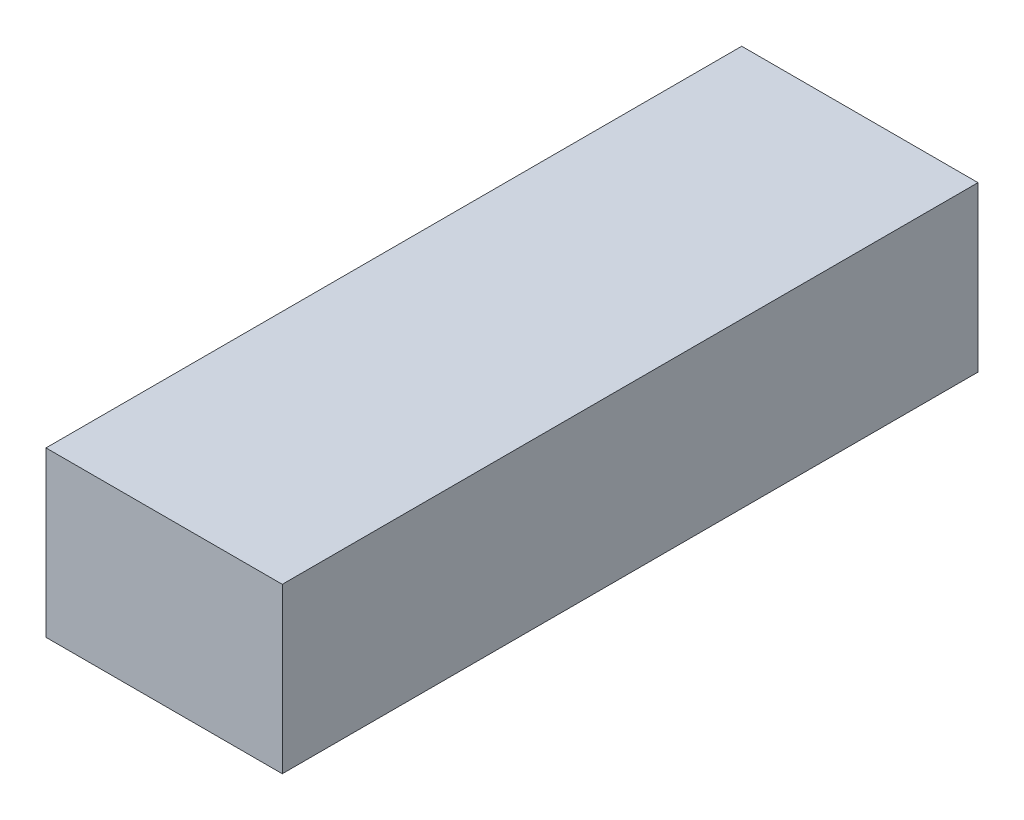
from build123d import *

# Parameters (mm, degrees)
SKETCH1_W           = 36
SKETCH1_H           = 25
BOSS_EXTRUDE1_DEPTH = 106


with BuildPart() as part:
    # Sketch1 → Boss-Extrude1 (new body)
    with BuildSketch(Plane.XY):
        with Locations((18, 12.5)):
            Rectangle(SKETCH1_W, SKETCH1_H)
    extrude(amount=BOSS_EXTRUDE1_DEPTH)


solid = part.part
